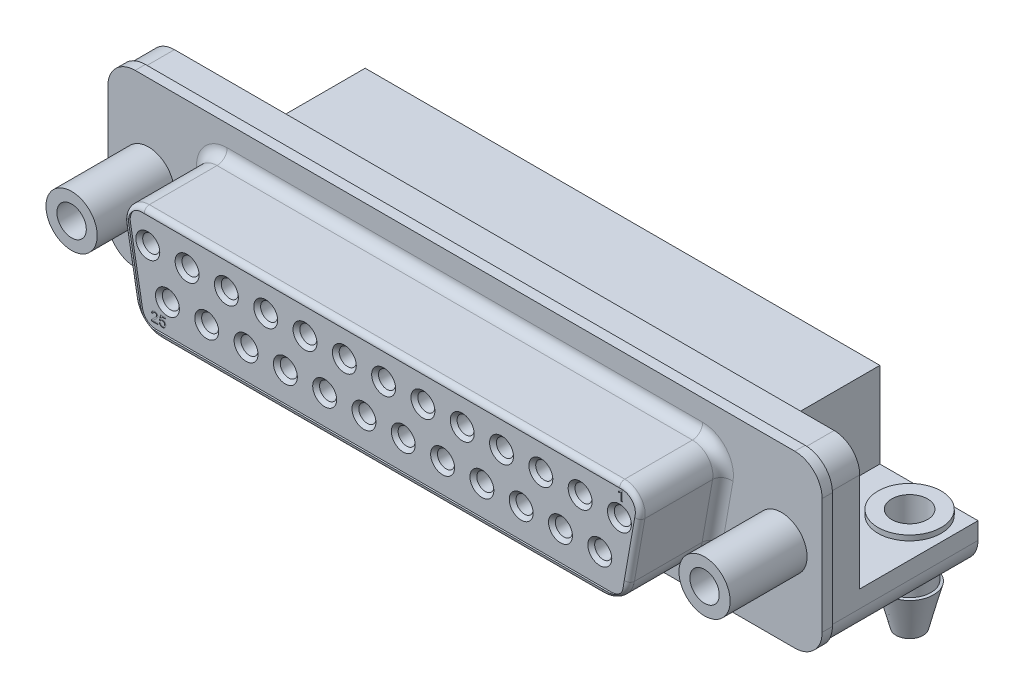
from build123d import *

# Parameters (mm, degrees)
SKETCH1_R               = 1.0922
BASE_EXTRUDE_DEPTH      = 0.762
PIN_BOSS_DEPTH          = 6.1722
FILLET1_R               = 0.762
FILLET2_R               = 0.381
PIN_FACE_RELEIF_DEPTH   = 0.127
BACKSIDE_BOSS_DEPTH     = 2.159
BACKSIDE_2_DEPTH        = 8.7884
SKETCH10_R              = 0.635
TOP_ROW_HOLES_DEPTH     = 6.35
SKETCH11_R              = 0.635
BOTTOM_ROW_HOLES_DEPTH  = 6.35
CHAMFER2_SIZE           = 0.254
SKETCH13_W              = 0.635
SKETCH13_H              = 0.635
PINS_PINS_PINS_DEPTH    = 4.2418
SKETCH15_R              = 1.905
SKETCH15_R_2            = 1.0922
THREADEDSTANDOFFS_DEPTH = 5.715
SKETCH16_R              = 1.5875
MOUNT_HOLES_DEPTH       = 31.204771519
F_1_PIN_DEPTH           = 0.0254
F_25PIN_DEPTH           = 0.0254


with BuildPart() as part:
    # Sketch1 → Base-Extrude (new body)
    with BuildSketch(Plane.XY):
        with BuildLine():
            Line((-24.513, -6.3373), (24.513, -6.3373))
            ThreePointArc((24.513, -6.3373), (25.949840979, -5.742140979), (26.545, -4.3053))
            Line((26.545, -4.3053), (26.545, 4.3053))
            ThreePointArc((26.545, 4.3053), (25.949840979, 5.742140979), (24.513, 6.3373))
            Line((24.513, 6.3373), (-24.513, 6.3373))
            ThreePointArc((-24.513, 6.3373), (-25.949840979, 5.742140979), (-26.545, 4.3053))
            Line((-26.545, 4.3053), (-26.545, -4.3053))
            ThreePointArc((-26.545, -4.3053), (-25.949840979, -5.742140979), (-24.513, -6.3373))
        make_face()
        with Locations(Location((23.5204, 0, 0), (0, 0, 180))):
            Circle(SKETCH1_R, mode=Mode.SUBTRACT)
        with Locations(Location((-23.5204, 0, 0), (0, 0, 180))):
            Circle(SKETCH1_R, mode=Mode.SUBTRACT)
    extrude(amount=BASE_EXTRUDE_DEPTH)

    # Sketch2 → Pin Boss (add)
    with BuildSketch(Plane.XY.offset(0.762)):
        with BuildLine():
            Line((-17.6657, 4.0132), (17.6657, 4.0132))
            ThreePointArc((17.6657, 4.0132), (18.833151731, 3.468808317), (19.166547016, 2.224560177))
            Line((19.166547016, 2.224560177), (18.385134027, -2.207053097))
            ThreePointArc((18.385134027, -2.207053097), (17.690149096, -3.410802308), (16.384004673, -3.8862))
            Line((16.384004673, -3.8862), (-16.384004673, -3.8862))
            ThreePointArc((-16.384004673, -3.8862), (-17.690149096, -3.410802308), (-18.385134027, -2.207053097))
            Line((-18.385134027, -2.207053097), (-19.166547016, 2.224560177))
            ThreePointArc((-19.166547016, 2.224560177), (-18.833151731, 3.468808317), (-17.6657, 4.0132))
        make_face()
    extrude(amount=PIN_BOSS_DEPTH)

    # Fillet1
    fillet1_edges = [part.edges().sort_by_distance(p)[0] for p in [
        (18.833151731, 3.468808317, 0.762),
        (0, 4.0132, 0.762),
        (-18.833151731, 3.468808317, 0.762),
        (-18.775840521, 0.00875354, 0.762),
        (-17.690149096, -3.410802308, 0.762),
        (0, -3.8862, 0.762),
        (17.690149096, -3.410802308, 0.762),
        (18.775840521, 0.00875354, 0.762),
    ]]
    fillet(fillet1_edges, radius=FILLET1_R)

    # Fillet2
    fillet2_edges = [part.edges().sort_by_distance(p)[0] for p in [
        (18.833151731, 3.468808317, 6.9342),
        (0, 4.0132, 6.9342),
        (-18.833151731, 3.468808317, 6.9342),
        (-18.775840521, 0.00875354, 6.9342),
        (-17.690149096, -3.410802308, 6.9342),
        (0, -3.8862, 6.9342),
        (17.690149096, -3.410802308, 6.9342),
        (18.775840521, 0.00875354, 6.9342),
    ]]
    fillet(fillet2_edges, radius=FILLET2_R)

    # Sketch3 → Pin Face Releif (cut)
    with BuildSketch(Plane.XY.offset(6.9342)):
        with BuildLine():
            Line((-17.817052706, 3.6322), (17.817052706, 3.6322))
            ThreePointArc((17.817052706, 3.6322), (18.59535386, 3.269272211), (18.817617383, 2.439773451))
            Line((18.817617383, 2.439773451), (17.917397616, -2.665626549))
            ThreePointArc((17.917397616, -2.665626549), (17.56990515, -3.267501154), (16.916832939, -3.5052))
            Line((16.916832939, -3.5052), (-16.916832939, -3.5052))
            ThreePointArc((-16.916832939, -3.5052), (-17.56990515, -3.267501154), (-17.917397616, -2.665626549))
            Line((-17.917397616, -2.665626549), (-18.817617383, 2.439773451))
            ThreePointArc((-18.817617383, 2.439773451), (-18.59535386, 3.269272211), (-17.817052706, 3.6322))
        make_face()
    extrude(amount=-PIN_FACE_RELEIF_DEPTH, mode=Mode.SUBTRACT)

    # Sketch5 → BACKSIDE BOSS (add)
    with BuildSketch(Plane(origin=(0, 0, 0), x_dir=(-1, 0, 0), z_dir=(0, 0, -1))):
        with BuildLine():
            Line((26.418, -4.3053), (26.418, 4.3053))
            ThreePointArc((26.418, 4.3053), (25.860038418, 5.652338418), (24.513, 6.2103))
            Line((24.513, 6.2103), (-24.513, 6.2103))
            ThreePointArc((-24.513, 6.2103), (-25.860038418, 5.652338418), (-26.418, 4.3053))
            Line((-26.418, 4.3053), (-26.418, -4.3053))
            ThreePointArc((-26.418, -4.3053), (-25.860038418, -5.652338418), (-24.513, -6.2103))
            Line((-24.513, -6.2103), (24.513, -6.2103))
            ThreePointArc((24.513, -6.2103), (25.860038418, -5.652338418), (26.418, -4.3053))
        make_face()
    extrude(amount=BACKSIDE_BOSS_DEPTH)

    # Sketch7 → backside_2 (add)
    with BuildSketch(Plane(origin=(0, 0, -2.159), x_dir=(-1, 0, 0), z_dir=(0, 0, -1))):
        with BuildLine():
            Line((24.513, -6.2103), (-24.513, -6.2103))
            ThreePointArc((-24.513, -6.2103), (-25.860038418, -5.652338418), (-26.418, -4.3053))
            Line((-26.418, -4.3053), (-26.418, -3.0353))
            Line((-26.418, -3.0353), (-19.1262, -3.0353))
            Line((-19.1262, -3.0353), (-19.1262, 3.3147))
            Line((-19.1262, 3.3147), (19.1262, 3.3147))
            Line((19.1262, 3.3147), (19.1262, -3.0353))
            Line((19.1262, -3.0353), (26.418, -3.0353))
            Line((26.418, -3.0353), (26.418, -4.3053))
            ThreePointArc((26.418, -4.3053), (25.860038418, -5.652338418), (24.513, -6.2103))
        make_face()
    extrude(amount=BACKSIDE_2_DEPTH)

    # Sketch10 → TOP ROW HOLES (cut)
    with BuildSketch(Plane.XY.offset(6.8072)):
        with Locations((0, 1.5875)):
            Circle(SKETCH10_R)
        with Locations((2.921, 1.5875)):
            Circle(SKETCH10_R)
        with Locations((5.842, 1.5875)):
            Circle(SKETCH10_R)
        with Locations((8.763, 1.5875)):
            Circle(SKETCH10_R)
        with Locations((11.684, 1.5875)):
            Circle(SKETCH10_R)
        with Locations((14.605, 1.5875)):
            Circle(SKETCH10_R)
        with Locations((17.526, 1.5875)):
            Circle(SKETCH10_R)
        with Locations(Location((-17.526, 1.5875, 0), (0, 0, 180))):
            Circle(SKETCH10_R)
        with Locations(Location((-14.605, 1.5875, 0), (0, 0, 180))):
            Circle(SKETCH10_R)
        with Locations(Location((-11.684, 1.5875, 0), (0, 0, 180))):
            Circle(SKETCH10_R)
        with Locations(Location((-8.763, 1.5875, 0), (0, 0, 180))):
            Circle(SKETCH10_R)
        with Locations(Location((-5.842, 1.5875, 0), (0, 0, 180))):
            Circle(SKETCH10_R)
        with Locations(Location((-2.921, 1.5875, 0), (0, 0, 180))):
            Circle(SKETCH10_R)
    extrude(amount=-TOP_ROW_HOLES_DEPTH, mode=Mode.SUBTRACT)

    # Sketch11 → BOTTOM ROW HOLES (cut)
    with BuildSketch(Plane.XY.offset(6.8072)):
        with Locations((-4.3815, -1.3335)):
            Circle(SKETCH11_R)
        with Locations((-7.3025, -1.3335)):
            Circle(SKETCH11_R)
        with Locations((-10.2235, -1.3335)):
            Circle(SKETCH11_R)
        with Locations((-13.1445, -1.3335)):
            Circle(SKETCH11_R)
        with Locations((-16.0655, -1.3335)):
            Circle(SKETCH11_R)
        with Locations(Location((1.4605, -1.3335, 0), (0, 0, 180))):
            Circle(SKETCH11_R)
        with Locations(Location((16.0655, -1.3335, 0), (0, 0, 180))):
            Circle(SKETCH11_R)
        with Locations(Location((13.1445, -1.3335, 0), (0, 0, 180))):
            Circle(SKETCH11_R)
        with Locations((-1.4605, -1.3335)):
            Circle(SKETCH11_R)
        with Locations(Location((10.2235, -1.3335, 0), (0, 0, 180))):
            Circle(SKETCH11_R)
        with Locations(Location((7.3025, -1.3335, 0), (0, 0, 180))):
            Circle(SKETCH11_R)
        with Locations(Location((4.3815, -1.3335, 0), (0, 0, 180))):
            Circle(SKETCH11_R)
    extrude(amount=-BOTTOM_ROW_HOLES_DEPTH, mode=Mode.SUBTRACT)

    # Chamfer2
    chamfer2_edges = [part.edges().sort_by_distance(p)[0] for p in [
        (-0.635, 1.5875, 6.8072),
        (2.286, 1.5875, 6.8072),
        (5.207, 1.5875, 6.8072),
        (8.128, 1.5875, 6.8072),
        (11.049, 1.5875, 6.8072),
        (13.97, 1.5875, 6.8072),
        (16.891, 1.5875, 6.8072),
        (-16.891, 1.5875, 6.8072),
        (-13.97, 1.5875, 6.8072),
        (-11.049, 1.5875, 6.8072),
        (-8.128, 1.5875, 6.8072),
        (-5.207, 1.5875, 6.8072),
        (-2.286, 1.5875, 6.8072),
        (-5.0165, -1.3335, 6.8072),
        (-7.9375, -1.3335, 6.8072),
        (-10.8585, -1.3335, 6.8072),
        (-13.7795, -1.3335, 6.8072),
        (-16.7005, -1.3335, 6.8072),
        (2.0955, -1.3335, 6.8072),
        (16.7005, -1.3335, 6.8072),
        (-2.0955, -1.3335, 6.8072),
        (13.7795, -1.3335, 6.8072),
        (10.8585, -1.3335, 6.8072),
        (7.9375, -1.3335, 6.8072),
        (5.0165, -1.3335, 6.8072),
    ]]
    chamfer(chamfer2_edges, length=CHAMFER2_SIZE)

    # Sketch13 → pins pins pins (add)
    with BuildSketch(Plane.XZ.offset(6.2103)):
        with Locations((-16.3175, -10.5029)):
            Rectangle(SKETCH13_W, SKETCH13_H)
        with Locations((-13.5997, -10.5029)):
            Rectangle(SKETCH13_W, SKETCH13_H)
        with Locations((-10.8819, -10.5029)):
            Rectangle(SKETCH13_W, SKETCH13_H)
        with Locations((-8.1641, -10.5029)):
            Rectangle(SKETCH13_W, SKETCH13_H)
        with Locations((-5.4463, -10.5029)):
            Rectangle(SKETCH13_W, SKETCH13_H)
        with Locations((-2.7285, -10.5029)):
            Rectangle(SKETCH13_W, SKETCH13_H)
        with Locations((-0.0107, -10.5029)):
            Rectangle(SKETCH13_W, SKETCH13_H)
        with Locations((2.7071, -10.5029)):
            Rectangle(SKETCH13_W, SKETCH13_H)
        with Locations((5.4249, -10.5029)):
            Rectangle(SKETCH13_W, SKETCH13_H)
        with Locations((8.1427, -10.5029)):
            Rectangle(SKETCH13_W, SKETCH13_H)
        with Locations((10.8605, -10.5029)):
            Rectangle(SKETCH13_W, SKETCH13_H)
        with Locations((13.5783, -10.5029)):
            Rectangle(SKETCH13_W, SKETCH13_H)
        with Locations((16.2961, -10.5029)):
            Rectangle(SKETCH13_W, SKETCH13_H)
        with Locations((-14.9459, -7.76732)):
            Rectangle(SKETCH13_W, SKETCH13_H)
        with Locations((-12.2281, -7.76732)):
            Rectangle(SKETCH13_W, SKETCH13_H)
        with Locations((-9.5103, -7.76732)):
            Rectangle(SKETCH13_W, SKETCH13_H)
        with Locations((-6.7925, -7.76732)):
            Rectangle(SKETCH13_W, SKETCH13_H)
        with Locations((-4.0747, -7.76732)):
            Rectangle(SKETCH13_W, SKETCH13_H)
        with Locations((-1.3569, -7.76732)):
            Rectangle(SKETCH13_W, SKETCH13_H)
        with Locations((1.3609, -7.76732)):
            Rectangle(SKETCH13_W, SKETCH13_H)
        with Locations((4.0787, -7.76732)):
            Rectangle(SKETCH13_W, SKETCH13_H)
        with Locations((6.7965, -7.76732)):
            Rectangle(SKETCH13_W, SKETCH13_H)
        with Locations((9.5143, -7.76732)):
            Rectangle(SKETCH13_W, SKETCH13_H)
        with Locations((12.2321, -7.76732)):
            Rectangle(SKETCH13_W, SKETCH13_H)
        with Locations((14.9499, -7.76732)):
            Rectangle(SKETCH13_W, SKETCH13_H)
    extrude(amount=PINS_PINS_PINS_DEPTH)

    # Sketch15 → Threadedstandoffs (add)
    # profile 1 of 2: a face of its own
    with BuildSketch(Plane.XY.offset(0.762)):
        with Locations((23.5204, 0)):
            Circle(SKETCH15_R)
        with Locations(Location((23.5204, 0, 0), (0, 0, 180))):
            Circle(SKETCH15_R_2, mode=Mode.SUBTRACT)
    # profile 2 of 2: a face of its own
    with BuildSketch(Plane.XY.offset(0.762)):
        with Locations((-23.5204, 0)):
            Circle(SKETCH15_R)
        with Locations(Location((-23.5204, 0, 0), (0, 0, 180))):
            Circle(SKETCH15_R_2, mode=Mode.SUBTRACT)
    extrude(amount=THREADEDSTANDOFFS_DEPTH)

    # Sketch16 → mount holes (cut, through all)
    with BuildSketch(Plane(origin=(0, -3.0353, 0), x_dir=(-1, 0, 0), z_dir=(0, 1, 0))):
        with Locations((-23.5204, -8.763)):
            Circle(SKETCH16_R)
        with Locations(Location((23.5204, -8.763, 0), (0, 0, 51.298738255))):
            Circle(SKETCH16_R)
    extrude(amount=-MOUNT_HOLES_DEPTH, mode=Mode.SUBTRACT)

    # Sketch17 → SNAP IN PEG (revolve)
    with BuildSketch(Plane(origin=(0, 0, -8.763), x_dir=(-1, 0, 0), z_dir=(0, 0, -1)), mode=Mode.PRIVATE) as snap_in_peg_sk:
        Polygon((-21.1709, -3.0353), (-21.1709, -2.6543), (-22.1869, -2.6543), (-22.1869, -7.423326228), (-22.051584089, -7.458066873), (-22.7584, -10.211137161), (-22.512378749, -10.2743), (-21.7424, -7.275208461), (-21.9329, -7.2263), (-21.9329, -3.0353), align=None)
    snap_in_peg = revolve(snap_in_peg_sk.sketch.rotate(Axis((23.5204, -6.90433229, -8.763), (0, 1, 0)), 180), axis=Axis((23.5204, -6.90433229, -8.763), (0, 1, 0)))

    # Mirror1: SNAP IN PEG across plane
    add(snap_in_peg.mirror(Plane(origin=(0, 0, 0), x_dir=(0, 0, 1), z_dir=(1, 0, 0))))

    # Sketch18 → 1 pin (cut)
    with BuildSketch(Plane.XY.offset(6.8072)):
        with BuildLine():
            Line((17.737958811, 2.708662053), (17.640541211, 2.708662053))
            Line((17.640541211, 2.708662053), (17.640541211, 3.300778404))
            add(Edge.make_bspline(
                [(17.640541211, 3.300778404), (17.634931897, 3.29536891), (17.623273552, 3.284125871), (17.603566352, 3.268214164), (17.581570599, 3.252086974), (17.557571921, 3.236578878), (17.533109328, 3.221979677), (17.509469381, 3.208849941), (17.48704676, 3.197738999), (17.472276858, 3.191663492), (17.46518953, 3.188748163)],
                knots=[0, 0, 0, 0, 0.893362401, 1.856755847, 2.901947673, 4.020460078, 5.132200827, 6.168787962, 7.121294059, 8, 8, 8, 8], degree=3))
            Line((17.46518953, 3.188748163), (17.46518953, 3.278555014))
            add(Edge.make_bspline(
                [(17.46518953, 3.278555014), (17.477362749, 3.284824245), (17.501355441, 3.29718053), (17.535251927, 3.318521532), (17.566897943, 3.341656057), (17.595769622, 3.366578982), (17.621651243, 3.392054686), (17.643462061, 3.417760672), (17.661711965, 3.44275467), (17.670868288, 3.460185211), (17.675246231, 3.468519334)],
                knots=[0, 0, 0, 0, 1.141258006, 2.249351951, 3.335817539, 4.406819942, 5.426913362, 6.360259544, 7.215985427, 8, 8, 8, 8], degree=3))
            Line((17.675246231, 3.468519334), (17.737958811, 3.468519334))
            Line((17.737958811, 3.468519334), (17.737958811, 2.708662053))
        make_face()
    extrude(amount=-F_1_PIN_DEPTH, mode=Mode.SUBTRACT)

    # Sketch19 → 25PIN (cut)
    with BuildSketch(Plane.XY.offset(6.8072)):
        with BuildLine():
            Line((-16.76818555, -3.043563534), (-16.76818555, -3.138666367))
            Line((-16.76818555, -3.138666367), (-17.253210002, -3.138666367))
            add(Edge.make_bspline(
                [(-17.253210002, -3.138666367), (-17.253219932, -3.133014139), (-17.253239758, -3.121728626), (-17.251330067, -3.105038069), (-17.248339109, -3.088568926), (-17.244957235, -3.07800792), (-17.243253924, -3.072688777)],
                knots=[0, 0, 0, 0, 1.01057331, 2.01775941, 3.001627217, 4, 4, 4, 4], degree=3))
            add(Edge.make_bspline(
                [(-17.243253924, -3.072688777), (-17.240106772, -3.063997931), (-17.233698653, -3.046301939), (-17.220715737, -3.020769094), (-17.205444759, -2.995390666), (-17.190576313, -2.974729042), (-17.176960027, -2.95822185), (-17.165540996, -2.945306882), (-17.152886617, -2.932086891), (-17.139007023, -2.91856429), (-17.124035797, -2.904651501), (-17.107952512, -2.890302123), (-17.090567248, -2.875783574), (-17.078430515, -2.866160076), (-17.072217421, -2.86123357)],
                knots=[0, 0, 0, 0, 1.204657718, 2.452881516, 3.728232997, 5.065887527, 5.768225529, 6.518857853, 7.313994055, 8.154655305, 9.046094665, 9.979688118, 10.965752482, 12, 12, 12, 12], degree=3))
            add(Edge.make_bspline(
                [(-17.072217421, -2.86123357), (-17.062672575, -2.853199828), (-17.044293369, -2.837730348), (-17.018339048, -2.814775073), (-16.994634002, -2.793459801), (-16.973555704, -2.773410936), (-16.954931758, -2.754822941), (-16.938718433, -2.737737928), (-16.924776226, -2.722209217), (-16.913275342, -2.707674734), (-16.903571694, -2.693950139), (-16.895348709, -2.680562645), (-16.888495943, -2.6672784), (-16.882788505, -2.65413944), (-16.878274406, -2.641089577), (-16.875197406, -2.628090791), (-16.873110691, -2.615272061), (-16.872901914, -2.606742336), (-16.872798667, -2.602524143)],
                knots=[0, 0, 0, 0, 1.782554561, 3.432421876, 4.950675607, 6.337395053, 7.588547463, 8.709982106, 9.702713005, 10.569305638, 11.356701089, 12.103210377, 12.812277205, 13.490692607, 14.148717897, 14.782152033, 15.397739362, 16, 16, 16, 16], degree=3))
            add(Edge.make_bspline(
                [(-16.872798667, -2.602524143), (-16.872901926, -2.598355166), (-16.873104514, -2.590175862), (-16.875026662, -2.578205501), (-16.877702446, -2.566677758), (-16.882028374, -2.555800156), (-16.887177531, -2.545250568), (-16.893782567, -2.535362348), (-16.901423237, -2.525889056), (-16.910171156, -2.517080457), (-16.919725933, -2.508816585), (-16.930402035, -2.5019473), (-16.941498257, -2.495762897), (-16.953397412, -2.490790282), (-16.966080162, -2.487138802), (-16.979454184, -2.484488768), (-16.993517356, -2.482808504), (-17.003114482, -2.482575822), (-17.008023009, -2.482456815)],
                knots=[0, 0, 0, 0, 0.988194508, 1.938783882, 2.870742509, 3.789494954, 4.709148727, 5.651055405, 6.603531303, 7.592354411, 8.592907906, 9.593461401, 10.59787167, 11.603930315, 12.645063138, 13.723588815, 14.835711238, 16, 16, 16, 16], degree=3))
            add(Edge.make_bspline(
                [(-17.008023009, -2.482456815), (-17.01317928, -2.482575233), (-17.023270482, -2.482806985), (-17.038021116, -2.48449395), (-17.052024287, -2.487071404), (-17.06524657, -2.491012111), (-17.077671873, -2.495976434), (-17.08924959, -2.502225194), (-17.100165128, -2.509278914), (-17.110074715, -2.517629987), (-17.119035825, -2.526889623), (-17.126991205, -2.536970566), (-17.133509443, -2.548067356), (-17.138892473, -2.559936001), (-17.143220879, -2.572613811), (-17.146363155, -2.586197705), (-17.148076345, -2.600648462), (-17.148420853, -2.610544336), (-17.148596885, -2.615600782)],
                knots=[0, 0, 0, 0, 1.131143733, 2.213731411, 3.253917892, 4.251203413, 5.236093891, 6.184197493, 7.13373276, 8.082770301, 9.020476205, 9.957489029, 10.893177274, 11.836722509, 12.812818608, 13.827831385, 14.890097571, 16, 16, 16, 16], degree=3))
            Line((-17.148596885, -2.615600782), (-17.243699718, -2.606090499))
            add(Edge.make_bspline(
                [(-17.243699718, -2.606090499), (-17.242726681, -2.597802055), (-17.240833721, -2.5816776), (-17.236118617, -2.558324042), (-17.229499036, -2.53659854), (-17.221578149, -2.516198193), (-17.211648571, -2.497470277), (-17.200424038, -2.480027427), (-17.187185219, -2.464422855), (-17.172559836, -2.450164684), (-17.156387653, -2.437599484), (-17.138820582, -2.426622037), (-17.119866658, -2.41744008), (-17.099631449, -2.409837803), (-17.078068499, -2.404069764), (-17.055208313, -2.399933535), (-17.031014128, -2.397383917), (-17.014419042, -2.397039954), (-17.005942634, -2.396864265)],
                knots=[0, 0, 0, 0, 1.130804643, 2.199883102, 3.223565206, 4.205909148, 5.160801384, 6.091796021, 7.01151579, 7.927798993, 8.855738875, 9.7815393, 10.730299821, 11.705391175, 12.706931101, 13.751121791, 14.851322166, 16, 16, 16, 16], degree=3))
            add(Edge.make_bspline(
                [(-17.005942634, -2.396864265), (-16.997364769, -2.397011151), (-16.980655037, -2.397297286), (-16.956306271, -2.400225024), (-16.933332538, -2.404784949), (-16.911649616, -2.411140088), (-16.891385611, -2.41947357), (-16.872524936, -2.429655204), (-16.854980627, -2.441585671), (-16.839045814, -2.455408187), (-16.824676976, -2.470497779), (-16.812084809, -2.486601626), (-16.801557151, -2.503650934), (-16.792593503, -2.521413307), (-16.785944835, -2.540264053), (-16.78126937, -2.559946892), (-16.778092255, -2.580478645), (-16.777829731, -2.594487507), (-16.777695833, -2.601632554)],
                knots=[0, 0, 0, 0, 1.195390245, 2.328627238, 3.413424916, 4.457841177, 5.473507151, 6.462241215, 7.441013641, 8.425227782, 9.397253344, 10.342087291, 11.269524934, 12.186751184, 13.110685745, 14.048630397, 15.004728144, 16, 16, 16, 16], degree=3))
            add(Edge.make_bspline(
                [(-16.777695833, -2.601632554), (-16.777900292, -2.608973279), (-16.778309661, -2.62367093), (-16.781504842, -2.645639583), (-16.78697183, -2.667369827), (-16.794219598, -2.689126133), (-16.804121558, -2.710994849), (-16.816631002, -2.733277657), (-16.832150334, -2.756056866), (-16.847075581, -2.775421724), (-16.860968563, -2.791654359), (-16.873283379, -2.805014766), (-16.887530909, -2.819209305), (-16.903176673, -2.834729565), (-16.920858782, -2.851024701), (-16.940069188, -2.868582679), (-16.961228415, -2.88694144), (-16.975917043, -2.899483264), (-16.983504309, -2.905961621)],
                knots=[0, 0, 0, 0, 0.927118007, 1.856282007, 2.79721255, 3.754929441, 4.749232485, 5.824981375, 6.979078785, 8.228161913, 8.911614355, 9.677694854, 10.522803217, 11.452009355, 12.461436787, 13.560019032, 14.739651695, 16, 16, 16, 16], degree=3))
            add(Edge.make_bspline(
                [(-16.983504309, -2.905961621), (-16.990001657, -2.911251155), (-17.0023911, -2.921337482), (-17.020017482, -2.935959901), (-17.03580536, -2.949368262), (-17.050123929, -2.961125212), (-17.062451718, -2.971799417), (-17.073222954, -2.980923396), (-17.082046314, -2.988955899), (-17.095482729, -3.001157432), (-17.112501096, -3.018549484), (-17.125040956, -3.035448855), (-17.1310623, -3.043563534)],
                knots=[0, 0, 0, 0, 1.241996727, 2.368296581, 3.394949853, 4.3125351, 5.114548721, 5.812230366, 6.404953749, 6.883082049, 8.503329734, 10, 10, 10, 10], degree=3))
            Line((-17.1310623, -3.043563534), (-16.76818555, -3.043563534))
        make_face()
        with BuildLine():
            Line((-16.663572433, -2.938950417), (-16.568469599, -2.929440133))
            add(Edge.make_bspline(
                [(-16.568469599, -2.929440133), (-16.567527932, -2.934798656), (-16.565696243, -2.945221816), (-16.562205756, -2.96030965), (-16.557672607, -2.974326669), (-16.552579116, -2.987394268), (-16.546524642, -2.999374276), (-16.539964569, -3.010455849), (-16.532228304, -3.020245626), (-16.52409466, -3.029255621), (-16.515167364, -3.037195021), (-16.505360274, -3.043888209), (-16.494947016, -3.04972761), (-16.483800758, -3.054508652), (-16.471904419, -3.058008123), (-16.459409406, -3.060775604), (-16.446154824, -3.062170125), (-16.437111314, -3.062444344), (-16.432502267, -3.0625841)],
                knots=[0, 0, 0, 0, 1.237781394, 2.407677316, 3.51963579, 4.58689595, 5.594855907, 6.570874, 7.510833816, 8.428091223, 9.330271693, 10.221190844, 11.124215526, 12.043132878, 12.973586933, 13.941700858, 14.950982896, 16, 16, 16, 16], degree=3))
            add(Edge.make_bspline(
                [(-16.432502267, -3.0625841), (-16.426847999, -3.062447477), (-16.415790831, -3.062180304), (-16.399704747, -3.05992066), (-16.384510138, -3.056194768), (-16.370279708, -3.05098066), (-16.356846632, -3.0444963), (-16.344656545, -3.036100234), (-16.333044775, -3.026662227), (-16.322758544, -3.01541031), (-16.313395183, -3.00316072), (-16.305313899, -2.989789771), (-16.2985106, -2.975485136), (-16.292782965, -2.960249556), (-16.288553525, -2.943995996), (-16.28544243, -2.926810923), (-16.283445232, -2.908683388), (-16.283257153, -2.896258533), (-16.283161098, -2.889913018)],
                knots=[0, 0, 0, 0, 1.052816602, 2.058828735, 3.018813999, 3.961574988, 4.877590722, 5.788574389, 6.712363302, 7.658909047, 8.620312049, 9.580784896, 10.562948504, 11.56722449, 12.607883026, 13.686460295, 14.818448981, 16, 16, 16, 16], degree=3))
            add(Edge.make_bspline(
                [(-16.283161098, -2.889913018), (-16.283270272, -2.883865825), (-16.283482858, -2.872090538), (-16.285273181, -2.854943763), (-16.288293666, -2.838820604), (-16.292201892, -2.823543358), (-16.297588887, -2.80935075), (-16.303978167, -2.796037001), (-16.311805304, -2.783884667), (-16.32051351, -2.77251537), (-16.330459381, -2.762323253), (-16.341777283, -2.753717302), (-16.354023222, -2.746185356), (-16.367443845, -2.740077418), (-16.382047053, -2.735539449), (-16.39768773, -2.732047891), (-16.414528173, -2.730211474), (-16.42610874, -2.729889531), (-16.432056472, -2.729724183)],
                knots=[0, 0, 0, 0, 1.165854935, 2.270189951, 3.319242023, 4.32700288, 5.306253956, 6.24172124, 7.169108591, 8.088047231, 8.999810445, 9.905349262, 10.822648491, 11.767237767, 12.739852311, 13.766490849, 14.852878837, 16, 16, 16, 16], degree=3))
            add(Edge.make_bspline(
                [(-16.432056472, -2.729724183), (-16.439452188, -2.729940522), (-16.453635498, -2.730355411), (-16.474015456, -2.733845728), (-16.492568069, -2.73948389), (-16.509083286, -2.747886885), (-16.523838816, -2.757925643), (-16.537141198, -2.769284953), (-16.549100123, -2.781957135), (-16.55566008, -2.791497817), (-16.558959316, -2.796296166)],
                knots=[0, 0, 0, 0, 1.182877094, 2.268490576, 3.298955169, 4.273890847, 5.221533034, 6.149304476, 7.069219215, 8, 8, 8, 8], degree=3))
            Line((-16.558959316, -2.796296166), (-16.65406215, -2.786785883))
            Line((-16.65406215, -2.786785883), (-16.577979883, -2.406374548))
            Line((-16.577979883, -2.406374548), (-16.226099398, -2.406374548))
            Line((-16.226099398, -2.406374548), (-16.226099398, -2.501477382))
            Line((-16.226099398, -2.501477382), (-16.500263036, -2.501477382))
            Line((-16.500263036, -2.501477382), (-16.538006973, -2.693614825))
            add(Edge.make_bspline(
                [(-16.538006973, -2.693614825), (-16.532759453, -2.689677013), (-16.522454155, -2.681943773), (-16.506379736, -2.671818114), (-16.49007547, -2.663282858), (-16.473636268, -2.656293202), (-16.456931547, -2.650848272), (-16.440062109, -2.647065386), (-16.422970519, -2.644508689), (-16.411509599, -2.644257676), (-16.405754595, -2.644131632)],
                knots=[0, 0, 0, 0, 1.093835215, 2.148119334, 3.164235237, 4.159999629, 5.123971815, 6.089888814, 7.040853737, 8, 8, 8, 8], degree=3))
            add(Edge.make_bspline(
                [(-16.405754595, -2.644131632), (-16.398264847, -2.64432787), (-16.383515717, -2.644714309), (-16.361782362, -2.647889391), (-16.34100162, -2.653279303), (-16.321010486, -2.66053873), (-16.302072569, -2.67016234), (-16.283996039, -2.681814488), (-16.266853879, -2.69559122), (-16.250742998, -2.711232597), (-16.236129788, -2.72859617), (-16.223050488, -2.747115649), (-16.21236803, -2.767161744), (-16.20338335, -2.788211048), (-16.196606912, -2.810609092), (-16.191463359, -2.834038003), (-16.188713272, -2.858790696), (-16.188280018, -2.875641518), (-16.188058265, -2.884266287)],
                knots=[0, 0, 0, 0, 0.991958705, 1.953407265, 2.902004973, 3.832128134, 4.765371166, 5.71007953, 6.676509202, 7.674246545, 8.68000108, 9.679398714, 10.671856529, 11.683459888, 12.706765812, 13.76733029, 14.85725088, 16, 16, 16, 16], degree=3))
            add(Edge.make_bspline(
                [(-16.188058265, -2.884266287), (-16.188226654, -2.892495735), (-16.188559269, -2.908751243), (-16.191285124, -2.93270674), (-16.195775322, -2.955789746), (-16.201786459, -2.978068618), (-16.20990831, -2.999416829), (-16.219759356, -3.019903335), (-16.23112309, -3.039741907), (-16.240236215, -3.051971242), (-16.244822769, -3.058126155)],
                knots=[0, 0, 0, 0, 1.059692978, 2.093196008, 3.100373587, 4.086253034, 5.061402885, 6.037282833, 7.012182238, 8, 8, 8, 8], degree=3))
            add(Edge.make_bspline(
                [(-16.244822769, -3.058126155), (-16.250649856, -3.065310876), (-16.262112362, -3.079443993), (-16.281959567, -3.097787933), (-16.303295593, -3.113377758), (-16.326247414, -3.126043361), (-16.350660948, -3.136221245), (-16.376836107, -3.142994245), (-16.404456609, -3.147542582), (-16.42341862, -3.147962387), (-16.43309666, -3.148176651)],
                knots=[0, 0, 0, 0, 1.023140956, 2.012628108, 2.982342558, 3.942221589, 4.908720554, 5.902469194, 6.929439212, 8, 8, 8, 8], degree=3))
            add(Edge.make_bspline(
                [(-16.43309666, -3.148176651), (-16.441079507, -3.14801472), (-16.456695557, -3.147697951), (-16.479560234, -3.144944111), (-16.501307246, -3.140552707), (-16.521943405, -3.134254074), (-16.541530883, -3.126295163), (-16.559842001, -3.116184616), (-16.577194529, -3.10461878), (-16.593206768, -3.091241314), (-16.607796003, -3.076320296), (-16.620868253, -3.060171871), (-16.632246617, -3.042785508), (-16.641925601, -3.024265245), (-16.649992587, -3.004628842), (-16.656164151, -2.983742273), (-16.661052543, -2.961810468), (-16.662723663, -2.946650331), (-16.663572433, -2.938950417)],
                knots=[0, 0, 0, 0, 1.108768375, 2.168973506, 3.19473529, 4.187459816, 5.162590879, 6.12651078, 7.088512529, 8.056012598, 9.019588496, 9.983680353, 10.938070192, 11.90157236, 12.88306954, 13.882379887, 14.924449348, 16, 16, 16, 16], degree=3))
        make_face()
    extrude(amount=-F_25PIN_DEPTH, mode=Mode.SUBTRACT)


solid = part.part
